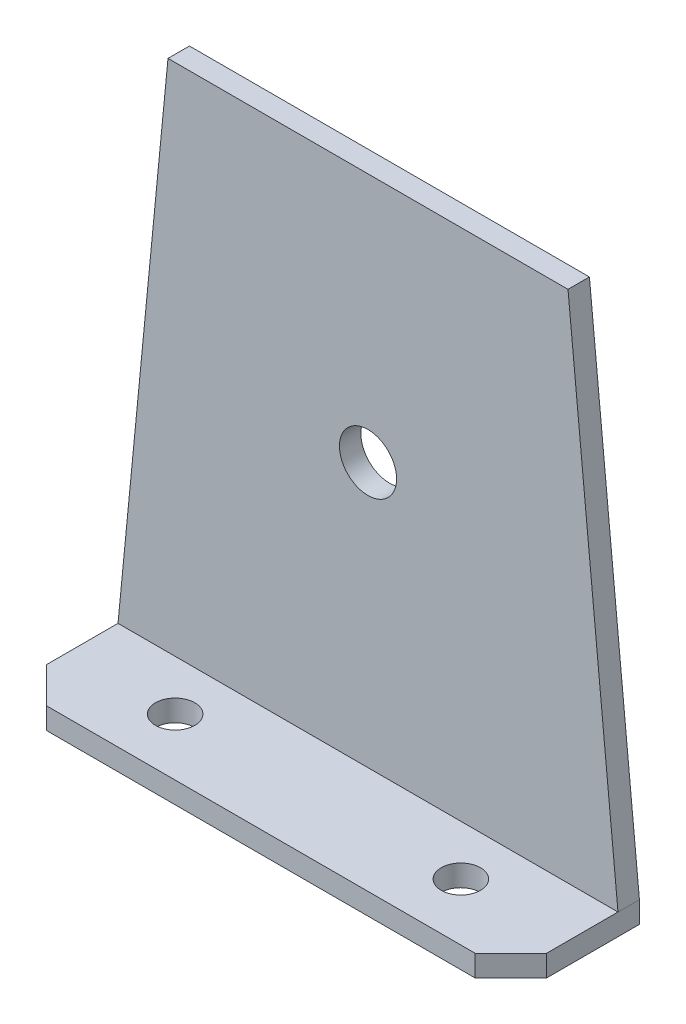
from build123d import *

# Parameters (mm, degrees)
EXTRUDE1_DEPTH     = 70
SKETCH2_R          = 4
CUT_EXTRUDE1_DEPTH = 70
SKETCH3_R          = 2.75
CUT_EXTRUDE2_DEPTH = 70
CHAMFER1_SIZE      = 5


with BuildPart() as part:
    # Sketch1 → Extrude1 (new body)
    with BuildSketch(Plane(origin=(0, 0, 0), x_dir=(0, 0, -1), z_dir=(1, 0, 0))):
        Polygon((0, 0), (-18, 0), (-18, 3), (-3, 3), (-3, 75), (0, 75), align=None)
    extrude(amount=EXTRUDE1_DEPTH)

    # Sketch2 → Cut-Extrude1 (cut)
    with BuildSketch(Plane.XY.offset(3)):
        with Locations((35, 40)):
            Circle(SKETCH2_R)
        Polygon((63, 75), (70, 3), (70, 75), align=None)
        Polygon((7, 75), (0, 3), (0, 75), align=None)
    extrude(amount=-CUT_EXTRUDE1_DEPTH, mode=Mode.SUBTRACT)

    # Sketch3 → Cut-Extrude2 (cut)
    with BuildSketch(Plane(origin=(0, 3, 0), x_dir=(-1, 0, 0), z_dir=(0, 1, 0))):
        with Locations(Location((-55, 10, 0), (0, 0, 90))):
            Circle(SKETCH3_R)
        with Locations(Location((-15, 10, 0), (0, 0, 90))):
            Circle(SKETCH3_R)
    extrude(amount=-CUT_EXTRUDE2_DEPTH, mode=Mode.SUBTRACT)

    # Chamfer1
    chamfer1_edges = [part.edges().sort_by_distance(p)[0] for p in [
        (70, 1.5, 18),
        (0, 1.5, 18),
    ]]
    chamfer(chamfer1_edges, length=CHAMFER1_SIZE)


solid = part.part
